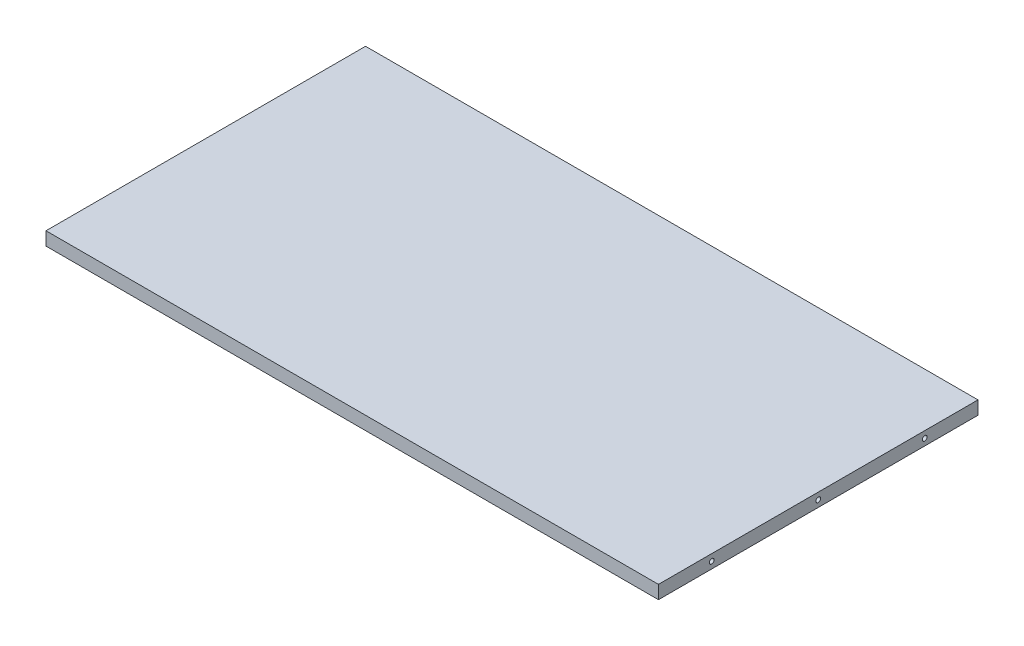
ISO-10303-21;
HEADER;
FILE_DESCRIPTION(('STEP AP214'),'2;1');
FILE_NAME('part.step','',(''),(''),'','','');
FILE_SCHEMA(('AUTOMOTIVE_DESIGN { 1 0 10303 214 1 1 1 1 }'));
ENDSEC;
DATA;
#1=APPLICATION_CONTEXT('core data for automotive mechanical design processes');
#2=APPLICATION_PROTOCOL_DEFINITION('international standard','automotive_design',2000,#1);
#3=PRODUCT_CONTEXT('',#1,'mechanical');
#4=PRODUCT('Part','Part','',(#3));
#5=PRODUCT_RELATED_PRODUCT_CATEGORY('part','',(#4));
#6=PRODUCT_DEFINITION_FORMATION('','',#4);
#7=PRODUCT_DEFINITION_CONTEXT('part definition',#1,'design');
#8=PRODUCT_DEFINITION('design','',#6,#7);
#9=PRODUCT_DEFINITION_SHAPE('','',#8);
#10=(LENGTH_UNIT() NAMED_UNIT(*) SI_UNIT(.MILLI.,.METRE.));
#11=(NAMED_UNIT(*) PLANE_ANGLE_UNIT() SI_UNIT($,.RADIAN.));
#12=(NAMED_UNIT(*) SI_UNIT($,.STERADIAN.) SOLID_ANGLE_UNIT());
#13=UNCERTAINTY_MEASURE_WITH_UNIT(LENGTH_MEASURE(1.E-05),#10,'distance_accuracy_value','');
#14=(GEOMETRIC_REPRESENTATION_CONTEXT(3) GLOBAL_UNCERTAINTY_ASSIGNED_CONTEXT((#13)) GLOBAL_UNIT_ASSIGNED_CONTEXT((#10,
#11,#12)) REPRESENTATION_CONTEXT('',''));
#15=CARTESIAN_POINT('',(0.,0.,0.));
#16=DIRECTION('',(0.,0.,1.));
#17=DIRECTION('',(1.,0.,0.));
#18=AXIS2_PLACEMENT_3D('',#15,#16,#17);
#19=CARTESIAN_POINT('',(146.05,6.35,76.2));
#20=DIRECTION('',(-1.,0.,0.));
#21=DIRECTION('',(0.,0.,1.));
#22=AXIS2_PLACEMENT_3D('',#19,#20,#21);
#23=PLANE('',#22);
#24=CARTESIAN_POINT('',(146.05,3.175,0.));
#25=DIRECTION('',(1.,0.,0.));
#26=DIRECTION('',(0.,0.,-1.));
#27=AXIS2_PLACEMENT_3D('',#24,#25,#26);
#28=CIRCLE('',#27,1.13029999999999);
#29=CARTESIAN_POINT('',(146.05,3.175,-1.13029999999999));
#30=VERTEX_POINT('',#29);
#31=EDGE_CURVE('E136',#30,#30,#28,.T.);
#32=ORIENTED_EDGE('',*,*,#31,.F.);
#33=EDGE_LOOP('',(#32));
#34=FACE_BOUND('',#33,.T.);
#35=CARTESIAN_POINT('',(146.05,3.175,50.8));
#36=DIRECTION('',(1.,0.,0.));
#37=DIRECTION('',(0.,0.,-1.));
#38=AXIS2_PLACEMENT_3D('',#35,#36,#37);
#39=CIRCLE('',#38,1.13029999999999);
#40=CARTESIAN_POINT('',(146.05,3.175,49.6697));
#41=VERTEX_POINT('',#40);
#42=EDGE_CURVE('E142',#41,#41,#39,.T.);
#43=ORIENTED_EDGE('',*,*,#42,.F.);
#44=EDGE_LOOP('',(#43));
#45=FACE_BOUND('',#44,.T.);
#46=CARTESIAN_POINT('',(146.05,3.175,-50.8));
#47=DIRECTION('',(1.,0.,0.));
#48=DIRECTION('',(0.,0.,-1.));
#49=AXIS2_PLACEMENT_3D('',#46,#47,#48);
#50=CIRCLE('',#49,1.13029999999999);
#51=CARTESIAN_POINT('',(146.05,3.175,-51.9303));
#52=VERTEX_POINT('',#51);
#53=EDGE_CURVE('E148',#52,#52,#50,.T.);
#54=ORIENTED_EDGE('',*,*,#53,.F.);
#55=EDGE_LOOP('',(#54));
#56=FACE_BOUND('',#55,.T.);
#57=DIRECTION('',(0.,0.,-1.));
#58=VECTOR('',#57,1.);
#59=CARTESIAN_POINT('',(146.05,0.,76.2));
#60=LINE('',#59,#58);
#61=CARTESIAN_POINT('',(146.05,0.,76.2));
#62=VERTEX_POINT('',#61);
#63=CARTESIAN_POINT('',(146.05,0.,-76.2));
#64=VERTEX_POINT('',#63);
#65=EDGE_CURVE('E154',#62,#64,#60,.T.);
#66=ORIENTED_EDGE('',*,*,#65,.T.);
#67=DIRECTION('',(0.,-1.,0.));
#68=VECTOR('',#67,1.);
#69=CARTESIAN_POINT('',(146.05,6.35,-76.2));
#70=LINE('',#69,#68);
#71=CARTESIAN_POINT('',(146.05,6.35,-76.2));
#72=VERTEX_POINT('',#71);
#73=EDGE_CURVE('E11',#72,#64,#70,.T.);
#74=ORIENTED_EDGE('',*,*,#73,.F.);
#75=DIRECTION('',(0.,0.,-1.));
#76=VECTOR('',#75,1.);
#77=CARTESIAN_POINT('',(146.05,6.35,76.2));
#78=LINE('',#77,#76);
#79=CARTESIAN_POINT('',(146.05,6.35,76.2));
#80=VERTEX_POINT('',#79);
#81=EDGE_CURVE('E155',#80,#72,#78,.T.);
#82=ORIENTED_EDGE('',*,*,#81,.F.);
#83=DIRECTION('',(0.,-1.,0.));
#84=VECTOR('',#83,1.);
#85=CARTESIAN_POINT('',(146.05,6.35,76.2));
#86=LINE('',#85,#84);
#87=EDGE_CURVE('E161',#80,#62,#86,.T.);
#88=ORIENTED_EDGE('',*,*,#87,.T.);
#89=EDGE_LOOP('',(#66,#74,#82,#88));
#90=FACE_BOUND('',#89,.T.);
#91=ADVANCED_FACE('F43',(#34,#45,#56,#90),#23,.F.);
#92=CARTESIAN_POINT('',(-146.05,6.35,-76.2));
#93=DIRECTION('',(0.,0.,1.));
#94=DIRECTION('',(1.,0.,0.));
#95=AXIS2_PLACEMENT_3D('',#92,#93,#94);
#96=PLANE('',#95);
#97=DIRECTION('',(-1.,0.,0.));
#98=VECTOR('',#97,1.);
#99=CARTESIAN_POINT('',(-146.05,0.,-76.2));
#100=LINE('',#99,#98);
#101=CARTESIAN_POINT('',(-146.05,0.,-76.2));
#102=VERTEX_POINT('',#101);
#103=EDGE_CURVE('E164',#64,#102,#100,.T.);
#104=ORIENTED_EDGE('',*,*,#103,.T.);
#105=DIRECTION('',(0.,-1.,0.));
#106=VECTOR('',#105,1.);
#107=CARTESIAN_POINT('',(-146.05,6.35,-76.2));
#108=LINE('',#107,#106);
#109=CARTESIAN_POINT('',(-146.05,6.35,-76.2));
#110=VERTEX_POINT('',#109);
#111=EDGE_CURVE('E51',#110,#102,#108,.T.);
#112=ORIENTED_EDGE('',*,*,#111,.F.);
#113=DIRECTION('',(-1.,0.,0.));
#114=VECTOR('',#113,1.);
#115=CARTESIAN_POINT('',(-146.05,6.35,-76.2));
#116=LINE('',#115,#114);
#117=EDGE_CURVE('E90',#72,#110,#116,.T.);
#118=ORIENTED_EDGE('',*,*,#117,.F.);
#119=ORIENTED_EDGE('',*,*,#73,.T.);
#120=EDGE_LOOP('',(#104,#112,#118,#119));
#121=FACE_BOUND('',#120,.T.);
#122=ADVANCED_FACE('F187',(#121),#96,.F.);
#123=CARTESIAN_POINT('',(-146.05,6.35,76.2));
#124=DIRECTION('',(1.,0.,0.));
#125=DIRECTION('',(0.,0.,-1.));
#126=AXIS2_PLACEMENT_3D('',#123,#124,#125);
#127=PLANE('',#126);
#128=CARTESIAN_POINT('',(-146.05,3.175,0.));
#129=DIRECTION('',(-1.,0.,0.));
#130=DIRECTION('',(0.,0.,1.));
#131=AXIS2_PLACEMENT_3D('',#128,#129,#130);
#132=CIRCLE('',#131,1.13029999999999);
#133=CARTESIAN_POINT('',(-146.05,3.175,1.13029999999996));
#134=VERTEX_POINT('',#133);
#135=EDGE_CURVE('E120',#134,#134,#132,.T.);
#136=ORIENTED_EDGE('',*,*,#135,.F.);
#137=EDGE_LOOP('',(#136));
#138=FACE_BOUND('',#137,.T.);
#139=CARTESIAN_POINT('',(-146.05,3.175,50.8));
#140=DIRECTION('',(-1.,0.,0.));
#141=DIRECTION('',(0.,0.,1.));
#142=AXIS2_PLACEMENT_3D('',#139,#140,#141);
#143=CIRCLE('',#142,1.13029999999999);
#144=CARTESIAN_POINT('',(-146.05,3.175,51.9303));
#145=VERTEX_POINT('',#144);
#146=EDGE_CURVE('E119',#145,#145,#143,.T.);
#147=ORIENTED_EDGE('',*,*,#146,.F.);
#148=EDGE_LOOP('',(#147));
#149=FACE_BOUND('',#148,.T.);
#150=CARTESIAN_POINT('',(-146.05,3.175,-50.8));
#151=DIRECTION('',(-1.,0.,0.));
#152=DIRECTION('',(0.,0.,1.));
#153=AXIS2_PLACEMENT_3D('',#150,#151,#152);
#154=CIRCLE('',#153,1.13029999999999);
#155=CARTESIAN_POINT('',(-146.05,3.175,-49.6697));
#156=VERTEX_POINT('',#155);
#157=EDGE_CURVE('E130',#156,#156,#154,.T.);
#158=ORIENTED_EDGE('',*,*,#157,.F.);
#159=EDGE_LOOP('',(#158));
#160=FACE_BOUND('',#159,.T.);
#161=DIRECTION('',(0.,0.,1.));
#162=VECTOR('',#161,1.);
#163=CARTESIAN_POINT('',(-146.05,0.,76.2));
#164=LINE('',#163,#162);
#165=CARTESIAN_POINT('',(-146.05,0.,76.2));
#166=VERTEX_POINT('',#165);
#167=EDGE_CURVE('E77',#102,#166,#164,.T.);
#168=ORIENTED_EDGE('',*,*,#167,.T.);
#169=DIRECTION('',(0.,-1.,0.));
#170=VECTOR('',#169,1.);
#171=CARTESIAN_POINT('',(-146.05,6.35,76.2));
#172=LINE('',#171,#170);
#173=CARTESIAN_POINT('',(-146.05,6.35,76.2));
#174=VERTEX_POINT('',#173);
#175=EDGE_CURVE('E169',#174,#166,#172,.T.);
#176=ORIENTED_EDGE('',*,*,#175,.F.);
#177=DIRECTION('',(0.,0.,1.));
#178=VECTOR('',#177,1.);
#179=CARTESIAN_POINT('',(-146.05,6.35,76.2));
#180=LINE('',#179,#178);
#181=EDGE_CURVE('E158',#110,#174,#180,.T.);
#182=ORIENTED_EDGE('',*,*,#181,.F.);
#183=ORIENTED_EDGE('',*,*,#111,.T.);
#184=EDGE_LOOP('',(#168,#176,#182,#183));
#185=FACE_BOUND('',#184,.T.);
#186=ADVANCED_FACE('F171',(#138,#149,#160,#185),#127,.F.);
#187=CARTESIAN_POINT('',(-146.05,6.35,76.2));
#188=DIRECTION('',(0.,0.,-1.));
#189=DIRECTION('',(-1.,0.,0.));
#190=AXIS2_PLACEMENT_3D('',#187,#188,#189);
#191=PLANE('',#190);
#192=DIRECTION('',(1.,0.,0.));
#193=VECTOR('',#192,1.);
#194=CARTESIAN_POINT('',(-146.05,0.,76.2));
#195=LINE('',#194,#193);
#196=EDGE_CURVE('E83',#166,#62,#195,.T.);
#197=ORIENTED_EDGE('',*,*,#196,.T.);
#198=ORIENTED_EDGE('',*,*,#87,.F.);
#199=DIRECTION('',(1.,0.,0.));
#200=VECTOR('',#199,1.);
#201=CARTESIAN_POINT('',(-146.05,6.35,76.2));
#202=LINE('',#201,#200);
#203=EDGE_CURVE('E59',#174,#80,#202,.T.);
#204=ORIENTED_EDGE('',*,*,#203,.F.);
#205=ORIENTED_EDGE('',*,*,#175,.T.);
#206=EDGE_LOOP('',(#197,#198,#204,#205));
#207=FACE_BOUND('',#206,.T.);
#208=ADVANCED_FACE('F178',(#207),#191,.F.);
#209=CARTESIAN_POINT('',(0.,6.35,0.));
#210=DIRECTION('',(0.,-1.,0.));
#211=DIRECTION('',(0.,0.,-1.));
#212=AXIS2_PLACEMENT_3D('',#209,#210,#211);
#213=PLANE('',#212);
#214=ORIENTED_EDGE('',*,*,#81,.T.);
#215=ORIENTED_EDGE('',*,*,#117,.T.);
#216=ORIENTED_EDGE('',*,*,#181,.T.);
#217=ORIENTED_EDGE('',*,*,#203,.T.);
#218=EDGE_LOOP('',(#214,#215,#216,#217));
#219=FACE_BOUND('',#218,.T.);
#220=ADVANCED_FACE('F180',(#219),#213,.F.);
#221=CARTESIAN_POINT('',(0.,0.,0.));
#222=DIRECTION('',(0.,-1.,0.));
#223=DIRECTION('',(0.,0.,-1.));
#224=AXIS2_PLACEMENT_3D('',#221,#222,#223);
#225=PLANE('',#224);
#226=ORIENTED_EDGE('',*,*,#65,.F.);
#227=ORIENTED_EDGE('',*,*,#196,.F.);
#228=ORIENTED_EDGE('',*,*,#167,.F.);
#229=ORIENTED_EDGE('',*,*,#103,.F.);
#230=EDGE_LOOP('',(#226,#227,#228,#229));
#231=FACE_BOUND('',#230,.T.);
#232=ADVANCED_FACE('F174',(#231),#225,.T.);
#233=CARTESIAN_POINT('',(138.43,3.175,-50.8));
#234=DIRECTION('',(1.,0.,0.));
#235=DIRECTION('',(0.,0.,-1.));
#236=AXIS2_PLACEMENT_3D('',#233,#234,#235);
#237=CONICAL_SURFACE('',#236,1.13029999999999,1.02974425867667);
#238=CARTESIAN_POINT('',(137.750847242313,3.175,-50.8));
#239=VERTEX_POINT('',#238);
#240=VERTEX_LOOP('',#239);
#241=FACE_BOUND('',#240,.T.);
#242=CARTESIAN_POINT('',(138.43,3.175,-50.8));
#243=DIRECTION('',(1.,0.,0.));
#244=DIRECTION('',(0.,0.,-1.));
#245=AXIS2_PLACEMENT_3D('',#242,#243,#244);
#246=CIRCLE('',#245,1.13029999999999);
#247=CARTESIAN_POINT('',(138.43,3.175,-51.9303));
#248=VERTEX_POINT('',#247);
#249=EDGE_CURVE('E151',#248,#248,#246,.T.);
#250=ORIENTED_EDGE('',*,*,#249,.T.);
#251=EDGE_LOOP('',(#250));
#252=FACE_BOUND('',#251,.T.);
#253=ADVANCED_FACE('F205',(#241,#252),#237,.F.);
#254=CARTESIAN_POINT('',(146.05,3.175,-50.8));
#255=DIRECTION('',(1.,0.,0.));
#256=DIRECTION('',(0.,0.,-1.));
#257=AXIS2_PLACEMENT_3D('',#254,#255,#256);
#258=CYLINDRICAL_SURFACE('',#257,1.13029999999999);
#259=ORIENTED_EDGE('',*,*,#249,.F.);
#260=EDGE_LOOP('',(#259));
#261=FACE_BOUND('',#260,.T.);
#262=ORIENTED_EDGE('',*,*,#53,.T.);
#263=EDGE_LOOP('',(#262));
#264=FACE_BOUND('',#263,.T.);
#265=ADVANCED_FACE('F202',(#261,#264),#258,.F.);
#266=CARTESIAN_POINT('',(138.43,3.175,50.8));
#267=DIRECTION('',(1.,0.,0.));
#268=DIRECTION('',(0.,0.,-1.));
#269=AXIS2_PLACEMENT_3D('',#266,#267,#268);
#270=CONICAL_SURFACE('',#269,1.13029999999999,1.02974425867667);
#271=CARTESIAN_POINT('',(137.750847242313,3.175,50.8));
#272=VERTEX_POINT('',#271);
#273=VERTEX_LOOP('',#272);
#274=FACE_BOUND('',#273,.T.);
#275=CARTESIAN_POINT('',(138.43,3.175,50.8));
#276=DIRECTION('',(1.,0.,0.));
#277=DIRECTION('',(0.,0.,-1.));
#278=AXIS2_PLACEMENT_3D('',#275,#276,#277);
#279=CIRCLE('',#278,1.13029999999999);
#280=CARTESIAN_POINT('',(138.43,3.175,49.6697));
#281=VERTEX_POINT('',#280);
#282=EDGE_CURVE('E145',#281,#281,#279,.T.);
#283=ORIENTED_EDGE('',*,*,#282,.T.);
#284=EDGE_LOOP('',(#283));
#285=FACE_BOUND('',#284,.T.);
#286=ADVANCED_FACE('F204',(#274,#285),#270,.F.);
#287=CARTESIAN_POINT('',(146.05,3.175,50.8));
#288=DIRECTION('',(1.,0.,0.));
#289=DIRECTION('',(0.,0.,-1.));
#290=AXIS2_PLACEMENT_3D('',#287,#288,#289);
#291=CYLINDRICAL_SURFACE('',#290,1.13029999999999);
#292=ORIENTED_EDGE('',*,*,#282,.F.);
#293=EDGE_LOOP('',(#292));
#294=FACE_BOUND('',#293,.T.);
#295=ORIENTED_EDGE('',*,*,#42,.T.);
#296=EDGE_LOOP('',(#295));
#297=FACE_BOUND('',#296,.T.);
#298=ADVANCED_FACE('F212',(#294,#297),#291,.F.);
#299=CARTESIAN_POINT('',(138.43,3.175,0.));
#300=DIRECTION('',(1.,0.,0.));
#301=DIRECTION('',(0.,0.,-1.));
#302=AXIS2_PLACEMENT_3D('',#299,#300,#301);
#303=CONICAL_SURFACE('',#302,1.13029999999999,1.02974425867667);
#304=CARTESIAN_POINT('',(137.750847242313,3.175,0.));
#305=VERTEX_POINT('',#304);
#306=VERTEX_LOOP('',#305);
#307=FACE_BOUND('',#306,.T.);
#308=CARTESIAN_POINT('',(138.43,3.175,0.));
#309=DIRECTION('',(1.,0.,0.));
#310=DIRECTION('',(0.,0.,-1.));
#311=AXIS2_PLACEMENT_3D('',#308,#309,#310);
#312=CIRCLE('',#311,1.13029999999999);
#313=CARTESIAN_POINT('',(138.43,3.175,-1.13029999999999));
#314=VERTEX_POINT('',#313);
#315=EDGE_CURVE('E139',#314,#314,#312,.T.);
#316=ORIENTED_EDGE('',*,*,#315,.T.);
#317=EDGE_LOOP('',(#316));
#318=FACE_BOUND('',#317,.T.);
#319=ADVANCED_FACE('F259',(#307,#318),#303,.F.);
#320=CARTESIAN_POINT('',(146.05,3.175,0.));
#321=DIRECTION('',(1.,0.,0.));
#322=DIRECTION('',(0.,0.,-1.));
#323=AXIS2_PLACEMENT_3D('',#320,#321,#322);
#324=CYLINDRICAL_SURFACE('',#323,1.13029999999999);
#325=ORIENTED_EDGE('',*,*,#315,.F.);
#326=EDGE_LOOP('',(#325));
#327=FACE_BOUND('',#326,.T.);
#328=ORIENTED_EDGE('',*,*,#31,.T.);
#329=EDGE_LOOP('',(#328));
#330=FACE_BOUND('',#329,.T.);
#331=ADVANCED_FACE('F271',(#327,#330),#324,.F.);
#332=CARTESIAN_POINT('',(-138.43,3.175,-50.8));
#333=DIRECTION('',(-1.,0.,0.));
#334=DIRECTION('',(0.,0.,1.));
#335=AXIS2_PLACEMENT_3D('',#332,#333,#334);
#336=CONICAL_SURFACE('',#335,1.13029999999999,1.02974425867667);
#337=CARTESIAN_POINT('',(-137.750847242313,3.175,-50.8));
#338=VERTEX_POINT('',#337);
#339=VERTEX_LOOP('',#338);
#340=FACE_BOUND('',#339,.T.);
#341=CARTESIAN_POINT('',(-138.43,3.175,-50.8));
#342=DIRECTION('',(-1.,0.,0.));
#343=DIRECTION('',(0.,0.,1.));
#344=AXIS2_PLACEMENT_3D('',#341,#342,#343);
#345=CIRCLE('',#344,1.13029999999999);
#346=CARTESIAN_POINT('',(-138.43,3.175,-49.6697));
#347=VERTEX_POINT('',#346);
#348=EDGE_CURVE('E133',#347,#347,#345,.T.);
#349=ORIENTED_EDGE('',*,*,#348,.T.);
#350=EDGE_LOOP('',(#349));
#351=FACE_BOUND('',#350,.T.);
#352=ADVANCED_FACE('F282',(#340,#351),#336,.F.);
#353=CARTESIAN_POINT('',(-146.05,3.175,-50.8));
#354=DIRECTION('',(-1.,0.,0.));
#355=DIRECTION('',(0.,0.,1.));
#356=AXIS2_PLACEMENT_3D('',#353,#354,#355);
#357=CYLINDRICAL_SURFACE('',#356,1.13029999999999);
#358=ORIENTED_EDGE('',*,*,#348,.F.);
#359=EDGE_LOOP('',(#358));
#360=FACE_BOUND('',#359,.T.);
#361=ORIENTED_EDGE('',*,*,#157,.T.);
#362=EDGE_LOOP('',(#361));
#363=FACE_BOUND('',#362,.T.);
#364=ADVANCED_FACE('F307',(#360,#363),#357,.F.);
#365=CARTESIAN_POINT('',(-138.43,3.175,50.8));
#366=DIRECTION('',(-1.,0.,0.));
#367=DIRECTION('',(0.,0.,1.));
#368=AXIS2_PLACEMENT_3D('',#365,#366,#367);
#369=CONICAL_SURFACE('',#368,1.13029999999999,1.02974425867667);
#370=CARTESIAN_POINT('',(-137.750847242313,3.175,50.8));
#371=VERTEX_POINT('',#370);
#372=VERTEX_LOOP('',#371);
#373=FACE_BOUND('',#372,.T.);
#374=CARTESIAN_POINT('',(-138.43,3.175,50.8));
#375=DIRECTION('',(-1.,0.,0.));
#376=DIRECTION('',(0.,0.,1.));
#377=AXIS2_PLACEMENT_3D('',#374,#375,#376);
#378=CIRCLE('',#377,1.13029999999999);
#379=CARTESIAN_POINT('',(-138.43,3.175,51.9303));
#380=VERTEX_POINT('',#379);
#381=EDGE_CURVE('E123',#380,#380,#378,.T.);
#382=ORIENTED_EDGE('',*,*,#381,.T.);
#383=EDGE_LOOP('',(#382));
#384=FACE_BOUND('',#383,.T.);
#385=ADVANCED_FACE('F318',(#373,#384),#369,.F.);
#386=CARTESIAN_POINT('',(-146.05,3.175,50.8));
#387=DIRECTION('',(-1.,0.,0.));
#388=DIRECTION('',(0.,0.,1.));
#389=AXIS2_PLACEMENT_3D('',#386,#387,#388);
#390=CYLINDRICAL_SURFACE('',#389,1.13029999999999);
#391=ORIENTED_EDGE('',*,*,#381,.F.);
#392=EDGE_LOOP('',(#391));
#393=FACE_BOUND('',#392,.T.);
#394=ORIENTED_EDGE('',*,*,#146,.T.);
#395=EDGE_LOOP('',(#394));
#396=FACE_BOUND('',#395,.T.);
#397=ADVANCED_FACE('F113',(#393,#396),#390,.F.);
#398=CARTESIAN_POINT('',(-138.43,3.175,0.));
#399=DIRECTION('',(-1.,0.,0.));
#400=DIRECTION('',(0.,0.,1.));
#401=AXIS2_PLACEMENT_3D('',#398,#399,#400);
#402=CONICAL_SURFACE('',#401,1.13029999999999,1.02974425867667);
#403=CARTESIAN_POINT('',(-137.750847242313,3.175,0.));
#404=VERTEX_POINT('',#403);
#405=VERTEX_LOOP('',#404);
#406=FACE_BOUND('',#405,.T.);
#407=CARTESIAN_POINT('',(-138.43,3.175,0.));
#408=DIRECTION('',(-1.,0.,0.));
#409=DIRECTION('',(0.,0.,1.));
#410=AXIS2_PLACEMENT_3D('',#407,#408,#409);
#411=CIRCLE('',#410,1.13029999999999);
#412=CARTESIAN_POINT('',(-138.43,3.175,1.13029999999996));
#413=VERTEX_POINT('',#412);
#414=EDGE_CURVE('E117',#413,#413,#411,.T.);
#415=ORIENTED_EDGE('',*,*,#414,.T.);
#416=EDGE_LOOP('',(#415));
#417=FACE_BOUND('',#416,.T.);
#418=ADVANCED_FACE('F109',(#406,#417),#402,.F.);
#419=CARTESIAN_POINT('',(-146.05,3.175,0.));
#420=DIRECTION('',(-1.,0.,0.));
#421=DIRECTION('',(0.,0.,1.));
#422=AXIS2_PLACEMENT_3D('',#419,#420,#421);
#423=CYLINDRICAL_SURFACE('',#422,1.13029999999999);
#424=ORIENTED_EDGE('',*,*,#414,.F.);
#425=EDGE_LOOP('',(#424));
#426=FACE_BOUND('',#425,.T.);
#427=ORIENTED_EDGE('',*,*,#135,.T.);
#428=EDGE_LOOP('',(#427));
#429=FACE_BOUND('',#428,.T.);
#430=ADVANCED_FACE('F112',(#426,#429),#423,.F.);
#431=CLOSED_SHELL('',(#91,#122,#186,#208,#220,#232,#253,#265,#286,#298,#319,#331,#352,#364,#385,
#397,#418,#430));
#432=MANIFOLD_SOLID_BREP('B2',#431);
#433=ADVANCED_BREP_SHAPE_REPRESENTATION('',(#18,#432),#14);
#434=SHAPE_DEFINITION_REPRESENTATION(#9,#433);
ENDSEC;
END-ISO-10303-21;
